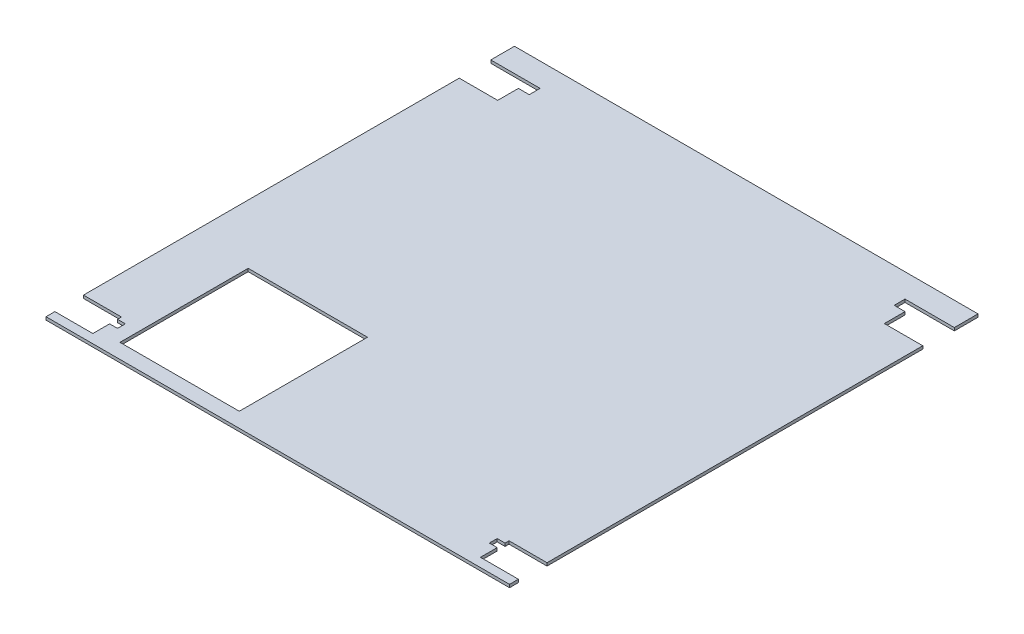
from build123d import *

# Parameters (mm, degrees)
SKETCH5_W               = 470
SKETCH5_H               = 475
BOSS_EXTRUDE4_DEPTH     = 3
CUT_EXTRUDE1_DEPTH      = 669.231995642
CUT_EXTRUDE2_DEPTH      = 669.231995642
CUT_EXTRUDE2_DEPTH_BACK = 669.231995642
SKETCH7_W               = 121
SKETCH7_H               = 130


with BuildPart() as part:
    # Sketch5 → Boss-Extrude4 (new body)
    with BuildSketch(Plane(origin=(0, 0, 0), x_dir=(1, 0, 0), z_dir=(0, 1, 0))):
        with Locations((235, 237.5)):
            Rectangle(SKETCH5_W, SKETCH5_H)
    extrude(amount=BOSS_EXTRUDE4_DEPTH)

    # Sketch1 → Cut-Extrude1 (cut, symmetric)
    with BuildSketch(Plane(origin=(0, 0, 0), x_dir=(1, 0, 0), z_dir=(0, 1, 0))):
        Polygon((23, 451), (0, 451), (0, 419), (39, 419), (39, 440), (50, 440), (50, 451), (39, 451), align=None)
        Polygon((0, 38), (38.5, 38), (38.5, 34), (46.5, 34), (46.5, 26), (38.5, 26), (38.5, 9), (0, 9), align=None)
    cut_extrude1 = extrude(amount=CUT_EXTRUDE1_DEPTH, both=True, mode=Mode.SUBTRACT)

    # Sketch7 → Cut-Extrude2 (cut, two sides: drawn at the far end of the back side and taken through both)
    with BuildSketch(Plane(origin=(0, 0, 0), x_dir=(1, 0, 0), z_dir=(0, 1, 0)).offset(-CUT_EXTRUDE2_DEPTH_BACK)):
        with Locations((120.5, 80)):
            Rectangle(SKETCH7_W, SKETCH7_H)
    extrude(amount=CUT_EXTRUDE2_DEPTH + CUT_EXTRUDE2_DEPTH_BACK, mode=Mode.SUBTRACT)

    # Mirror1: Cut-Extrude1 across plane
    add(cut_extrude1.mirror(Plane(origin=(235, 0, 0), x_dir=(0, 0, 1), z_dir=(1, 0, 0))), mode=Mode.SUBTRACT)


solid = part.part
